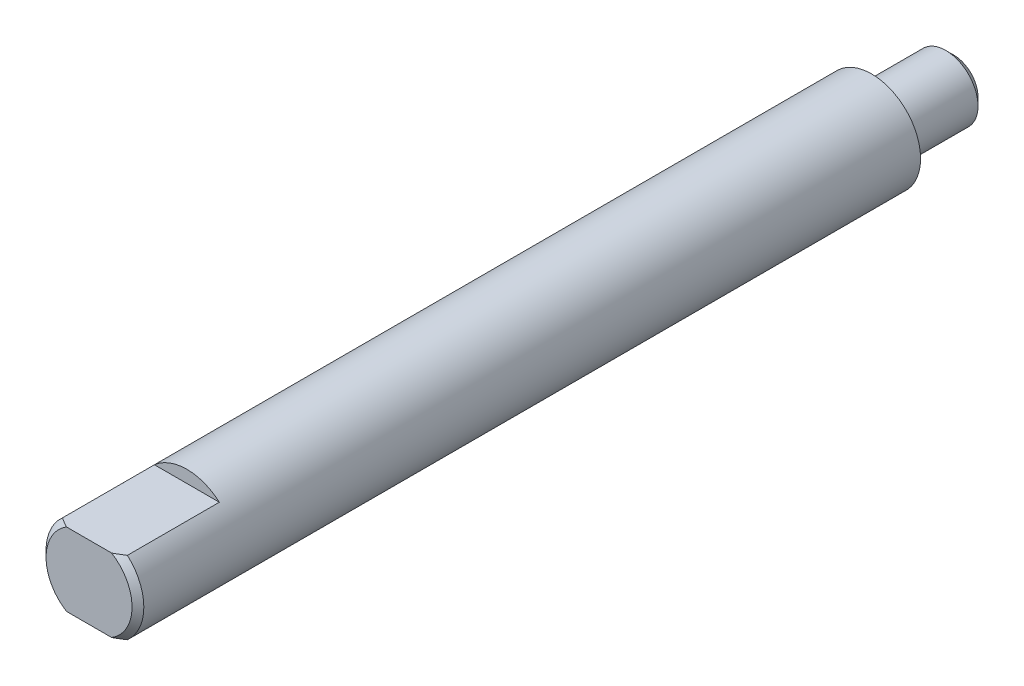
ISO-10303-21;
HEADER;
FILE_DESCRIPTION(('STEP AP214'),'2;1');
FILE_NAME('part.step','',(''),(''),'','','');
FILE_SCHEMA(('AUTOMOTIVE_DESIGN { 1 0 10303 214 1 1 1 1 }'));
ENDSEC;
DATA;
#1=APPLICATION_CONTEXT('core data for automotive mechanical design processes');
#2=APPLICATION_PROTOCOL_DEFINITION('international standard','automotive_design',2000,#1);
#3=PRODUCT_CONTEXT('',#1,'mechanical');
#4=PRODUCT('Part','Part','',(#3));
#5=PRODUCT_RELATED_PRODUCT_CATEGORY('part','',(#4));
#6=PRODUCT_DEFINITION_FORMATION('','',#4);
#7=PRODUCT_DEFINITION_CONTEXT('part definition',#1,'design');
#8=PRODUCT_DEFINITION('design','',#6,#7);
#9=PRODUCT_DEFINITION_SHAPE('','',#8);
#10=(LENGTH_UNIT() NAMED_UNIT(*) SI_UNIT(.MILLI.,.METRE.));
#11=(NAMED_UNIT(*) PLANE_ANGLE_UNIT() SI_UNIT($,.RADIAN.));
#12=(NAMED_UNIT(*) SI_UNIT($,.STERADIAN.) SOLID_ANGLE_UNIT());
#13=UNCERTAINTY_MEASURE_WITH_UNIT(LENGTH_MEASURE(1.E-05),#10,'distance_accuracy_value','');
#14=(GEOMETRIC_REPRESENTATION_CONTEXT(3) GLOBAL_UNCERTAINTY_ASSIGNED_CONTEXT((#13)) GLOBAL_UNIT_ASSIGNED_CONTEXT((#10,
#11,#12)) REPRESENTATION_CONTEXT('',''));
#15=CARTESIAN_POINT('',(0.,0.,0.));
#16=DIRECTION('',(0.,0.,1.));
#17=DIRECTION('',(1.,0.,0.));
#18=AXIS2_PLACEMENT_3D('',#15,#16,#17);
#19=CARTESIAN_POINT('',(0.,0.,3.684));
#20=DIRECTION('',(0.,0.,-1.));
#21=DIRECTION('',(-1.,0.,0.));
#22=AXIS2_PLACEMENT_3D('',#19,#20,#21);
#23=CONICAL_SURFACE('',#22,3.175,0.791934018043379);
#24=CARTESIAN_POINT('',(0.,0.,3.684));
#25=DIRECTION('',(0.,0.,1.));
#26=DIRECTION('',(1.,0.,0.));
#27=AXIS2_PLACEMENT_3D('',#24,#25,#26);
#28=CIRCLE('',#27,3.175);
#29=CARTESIAN_POINT('',(-2.10713075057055,2.375,3.684));
#30=VERTEX_POINT('',#29);
#31=CARTESIAN_POINT('',(-2.10713075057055,-2.375,3.684));
#32=VERTEX_POINT('',#31);
#33=EDGE_CURVE('E105',#30,#32,#28,.T.);
#34=ORIENTED_EDGE('',*,*,#33,.T.);
#35=CARTESIAN_POINT('',(-6.62966945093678,-2.375,-0.13301595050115));
#36=CARTESIAN_POINT('',(-6.41872085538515,-2.375,0.0629362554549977));
#37=CARTESIAN_POINT('',(-6.20729327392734,-2.375,0.258380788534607));
#38=CARTESIAN_POINT('',(-5.78286017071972,-2.375,0.64788739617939));
#39=CARTESIAN_POINT('',(-5.56985352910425,-2.375,0.841948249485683));
#40=CARTESIAN_POINT('',(-5.13574053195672,-2.375,1.23363349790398));
#41=CARTESIAN_POINT('',(-4.9145790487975,-2.375,1.43119690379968));
#42=CARTESIAN_POINT('',(-4.46963283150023,-2.375,1.82304516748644));
#43=CARTESIAN_POINT('',(-4.24585006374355,-2.375,2.01733224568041));
#44=CARTESIAN_POINT('',(-3.90719638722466,-2.375,2.30510248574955));
#45=CARTESIAN_POINT('',(-3.79385459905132,-2.375,2.40038380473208));
#46=CARTESIAN_POINT('',(-3.56590809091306,-2.375,2.5894215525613));
#47=CARTESIAN_POINT('',(-3.4513034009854,-2.375,2.68317801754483));
#48=CARTESIAN_POINT('',(-3.22025369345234,-2.375,2.86895465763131));
#49=CARTESIAN_POINT('',(-3.10380502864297,-2.375,2.96097030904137));
#50=CARTESIAN_POINT('',(-2.8689222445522,-2.375,3.14241965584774));
#51=CARTESIAN_POINT('',(-2.75048831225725,-2.375,3.23185359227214));
#52=CARTESIAN_POINT('',(-2.51255729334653,-2.375,3.40617108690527));
#53=CARTESIAN_POINT('',(-2.3930916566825,-2.375,3.49109735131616));
#54=CARTESIAN_POINT('',(-2.1509050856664,-2.375,3.65634247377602));
#55=CARTESIAN_POINT('',(-2.02818269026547,-2.375,3.73665921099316));
#56=CARTESIAN_POINT('',(-1.77912466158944,-2.375,3.89039659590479));
#57=CARTESIAN_POINT('',(-1.65280524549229,-2.375,3.96384327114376));
#58=CARTESIAN_POINT('',(-1.39512518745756,-2.375,4.10119391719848));
#59=CARTESIAN_POINT('',(-1.26377071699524,-2.375,4.16510912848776));
#60=CARTESIAN_POINT('',(-1.05701971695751,-2.375,4.25273595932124));
#61=CARTESIAN_POINT('',(-0.983728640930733,-2.375,4.28140199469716));
#62=CARTESIAN_POINT('',(-0.83535687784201,-2.375,4.3337772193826));
#63=CARTESIAN_POINT('',(-0.760275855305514,-2.375,4.35748547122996));
#64=CARTESIAN_POINT('',(-0.608898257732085,-2.375,4.39885359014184));
#65=CARTESIAN_POINT('',(-0.532610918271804,-2.375,4.41654679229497));
#66=CARTESIAN_POINT('',(-0.378780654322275,-2.375,4.445154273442));
#67=CARTESIAN_POINT('',(-0.301238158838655,-2.375,4.45607082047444));
#68=CARTESIAN_POINT('',(-0.144559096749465,-2.375,4.47054748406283));
#69=CARTESIAN_POINT('',(-0.0654144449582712,-2.375,4.47402190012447));
#70=CARTESIAN_POINT('',(0.0928249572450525,-2.375,4.47312081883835));
#71=CARTESIAN_POINT('',(0.171919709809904,-2.375,4.4687456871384));
#72=CARTESIAN_POINT('',(0.329626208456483,-2.375,4.45241265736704));
#73=CARTESIAN_POINT('',(0.408234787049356,-2.375,4.44042470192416));
#74=CARTESIAN_POINT('',(0.56408615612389,-2.375,4.40957980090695));
#75=CARTESIAN_POINT('',(0.641328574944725,-2.375,4.39072101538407));
#76=CARTESIAN_POINT('',(0.827865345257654,-2.375,4.33746225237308));
#77=CARTESIAN_POINT('',(0.936246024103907,-2.375,4.29987709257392));
#78=CARTESIAN_POINT('',(1.14927492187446,-2.375,4.21535984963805));
#79=CARTESIAN_POINT('',(1.25392057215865,-2.375,4.16842147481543));
#80=CARTESIAN_POINT('',(1.46087103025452,-2.375,4.06709514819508));
#81=CARTESIAN_POINT('',(1.56313950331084,-2.375,4.01263383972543));
#82=CARTESIAN_POINT('',(1.71427099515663,-2.375,3.92703840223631));
#83=CARTESIAN_POINT('',(1.76426245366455,-2.375,3.89786057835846));
#84=CARTESIAN_POINT('',(1.86356372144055,-2.375,3.83837009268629));
#85=CARTESIAN_POINT('',(1.91287355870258,-2.375,3.80805747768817));
#86=CARTESIAN_POINT('',(2.07522042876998,-2.375,3.70601224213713));
#87=CARTESIAN_POINT('',(2.18692206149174,-2.375,3.63215349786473));
#88=CARTESIAN_POINT('',(2.40772318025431,-2.375,3.48062951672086));
#89=CARTESIAN_POINT('',(2.5168220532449,-2.375,3.40296339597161));
#90=CARTESIAN_POINT('',(2.73301390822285,-2.375,3.24473477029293));
#91=CARTESIAN_POINT('',(2.84010537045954,-2.375,3.16417019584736));
#92=CARTESIAN_POINT('',(3.05261723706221,-2.375,3.00086187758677));
#93=CARTESIAN_POINT('',(3.15803753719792,-2.375,2.9181179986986));
#94=CARTESIAN_POINT('',(3.47300086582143,-2.375,2.6667998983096));
#95=CARTESIAN_POINT('',(3.68051445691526,-2.375,2.49568568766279));
#96=CARTESIAN_POINT('',(4.09182405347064,-2.375,2.14926116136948));
#97=CARTESIAN_POINT('',(4.29562161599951,-2.375,1.97395267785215));
#98=CARTESIAN_POINT('',(4.67931232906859,-2.375,1.63905531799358));
#99=CARTESIAN_POINT('',(4.85946034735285,-2.375,1.47975783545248));
#100=CARTESIAN_POINT('',(5.21824582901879,-2.375,1.15942835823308));
#101=CARTESIAN_POINT('',(5.39688309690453,-2.375,0.998396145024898));
#102=CARTESIAN_POINT('',(5.75173692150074,-2.375,0.676174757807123));
#103=CARTESIAN_POINT('',(5.92796166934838,-2.375,0.514994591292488));
#104=CARTESIAN_POINT('',(6.27946145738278,-2.375,0.191659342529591));
#105=CARTESIAN_POINT('',(6.45473664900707,-2.375,0.0295044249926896));
#106=CARTESIAN_POINT('',(6.62966945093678,-2.375,-0.13301595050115));
#107=B_SPLINE_CURVE_WITH_KNOTS('',3,(#35,#36,#37,#38,#39,#40,#41,#42,#43,#44,#45,#46,#47,#48,
#49,#50,#51,#52,#53,#54,#55,#56,#57,#58,#59,#60,#61,#62,#63,#64,#65,#66,#67,#68,#69,#70,#71,#72,
#73,#74,#75,#76,#77,#78,#79,#80,#81,#82,#83,#84,#85,#86,#87,#88,#89,#90,#91,#92,#93,#94,#95,#96,
#97,#98,#99,#100,#101,#102,#103,#104,#105,#106),.UNSPECIFIED.,.F.,.F.,(4,2,2,2,2,2,2,2,2,2,2,2,
2,2,2,2,2,2,2,2,2,2,2,2,2,2,2,2,2,2,2,2,2,2,2,4),(0.,0.863760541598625,1.72820709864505,
2.61784876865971,3.50686109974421,3.95106286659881,4.39525409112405,4.84047397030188,
5.28565214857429,5.72530383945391,6.16515621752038,6.60326828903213,7.04085953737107,
7.2768120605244,7.51280915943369,7.74747620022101,7.98206465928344,8.21934033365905,
8.45660495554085,8.69481223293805,8.93308334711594,9.27660606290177,9.62036064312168,
9.96774119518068,10.1413805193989,10.3150126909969,10.7166254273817,11.1183318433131,
11.5203310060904,11.9223551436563,12.7291420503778,13.5355827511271,14.2569976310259,
14.9785044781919,15.6949553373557,16.4112883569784),.UNSPECIFIED.);
#108=CARTESIAN_POINT('',(-1.46406113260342,-2.375,4.064));
#109=VERTEX_POINT('',#108);
#110=EDGE_CURVE('E128',#32,#109,#107,.T.);
#111=ORIENTED_EDGE('',*,*,#110,.T.);
#112=CARTESIAN_POINT('',(0.,0.,4.064));
#113=DIRECTION('',(0.,0.,1.));
#114=DIRECTION('',(1.,0.,0.));
#115=AXIS2_PLACEMENT_3D('',#112,#113,#114);
#116=CIRCLE('',#115,2.79);
#117=CARTESIAN_POINT('',(-1.46406113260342,2.375,4.064));
#118=VERTEX_POINT('',#117);
#119=EDGE_CURVE('E115',#118,#109,#116,.T.);
#120=ORIENTED_EDGE('',*,*,#119,.F.);
#121=CARTESIAN_POINT('',(6.62966945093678,2.375,-0.13301595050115));
#122=CARTESIAN_POINT('',(6.41872085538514,2.375,0.0629362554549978));
#123=CARTESIAN_POINT('',(6.20729327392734,2.375,0.258380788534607));
#124=CARTESIAN_POINT('',(5.78286017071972,2.375,0.64788739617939));
#125=CARTESIAN_POINT('',(5.56985352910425,2.375,0.841948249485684));
#126=CARTESIAN_POINT('',(5.13574053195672,2.375,1.23363349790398));
#127=CARTESIAN_POINT('',(4.9145790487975,2.375,1.43119690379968));
#128=CARTESIAN_POINT('',(4.46963283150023,2.375,1.82304516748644));
#129=CARTESIAN_POINT('',(4.24585006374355,2.375,2.01733224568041));
#130=CARTESIAN_POINT('',(3.90719638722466,2.375,2.30510248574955));
#131=CARTESIAN_POINT('',(3.79385459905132,2.375,2.40038380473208));
#132=CARTESIAN_POINT('',(3.56590809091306,2.375,2.5894215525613));
#133=CARTESIAN_POINT('',(3.4513034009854,2.375,2.68317801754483));
#134=CARTESIAN_POINT('',(3.22025369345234,2.375,2.86895465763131));
#135=CARTESIAN_POINT('',(3.10380502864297,2.375,2.96097030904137));
#136=CARTESIAN_POINT('',(2.8689222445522,2.375,3.14241965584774));
#137=CARTESIAN_POINT('',(2.75048831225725,2.375,3.23185359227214));
#138=CARTESIAN_POINT('',(2.51255729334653,2.375,3.40617108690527));
#139=CARTESIAN_POINT('',(2.3930916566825,2.375,3.49109735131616));
#140=CARTESIAN_POINT('',(2.1509050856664,2.375,3.65634247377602));
#141=CARTESIAN_POINT('',(2.02818269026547,2.375,3.73665921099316));
#142=CARTESIAN_POINT('',(1.77912466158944,2.375,3.89039659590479));
#143=CARTESIAN_POINT('',(1.65280524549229,2.375,3.96384327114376));
#144=CARTESIAN_POINT('',(1.39512518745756,2.375,4.10119391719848));
#145=CARTESIAN_POINT('',(1.26377071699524,2.375,4.16510912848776));
#146=CARTESIAN_POINT('',(1.05701971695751,2.375,4.25273595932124));
#147=CARTESIAN_POINT('',(0.983728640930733,2.375,4.28140199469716));
#148=CARTESIAN_POINT('',(0.83535687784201,2.375,4.3337772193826));
#149=CARTESIAN_POINT('',(0.760275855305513,2.375,4.35748547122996));
#150=CARTESIAN_POINT('',(0.608898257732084,2.375,4.39885359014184));
#151=CARTESIAN_POINT('',(0.532610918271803,2.375,4.41654679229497));
#152=CARTESIAN_POINT('',(0.378780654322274,2.375,4.445154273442));
#153=CARTESIAN_POINT('',(0.301238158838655,2.375,4.45607082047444));
#154=CARTESIAN_POINT('',(0.144559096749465,2.375,4.47054748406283));
#155=CARTESIAN_POINT('',(0.0654144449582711,2.375,4.47402190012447));
#156=CARTESIAN_POINT('',(-0.0928249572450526,2.375,4.47312081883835));
#157=CARTESIAN_POINT('',(-0.171919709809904,2.375,4.4687456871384));
#158=CARTESIAN_POINT('',(-0.329626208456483,2.375,4.45241265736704));
#159=CARTESIAN_POINT('',(-0.408234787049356,2.375,4.44042470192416));
#160=CARTESIAN_POINT('',(-0.56408615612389,2.375,4.40957980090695));
#161=CARTESIAN_POINT('',(-0.641328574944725,2.375,4.39072101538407));
#162=CARTESIAN_POINT('',(-0.827865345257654,2.375,4.33746225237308));
#163=CARTESIAN_POINT('',(-0.936246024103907,2.375,4.29987709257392));
#164=CARTESIAN_POINT('',(-1.14927492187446,2.375,4.21535984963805));
#165=CARTESIAN_POINT('',(-1.25392057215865,2.375,4.16842147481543));
#166=CARTESIAN_POINT('',(-1.46087103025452,2.375,4.06709514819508));
#167=CARTESIAN_POINT('',(-1.56313950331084,2.375,4.01263383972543));
#168=CARTESIAN_POINT('',(-1.71427099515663,2.375,3.92703840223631));
#169=CARTESIAN_POINT('',(-1.76426245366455,2.375,3.89786057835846));
#170=CARTESIAN_POINT('',(-1.86356372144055,2.375,3.83837009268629));
#171=CARTESIAN_POINT('',(-1.91287355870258,2.375,3.80805747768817));
#172=CARTESIAN_POINT('',(-2.07522042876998,2.375,3.70601224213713));
#173=CARTESIAN_POINT('',(-2.18692206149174,2.375,3.63215349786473));
#174=CARTESIAN_POINT('',(-2.40772318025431,2.375,3.48062951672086));
#175=CARTESIAN_POINT('',(-2.51682205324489,2.375,3.40296339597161));
#176=CARTESIAN_POINT('',(-2.73301390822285,2.375,3.24473477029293));
#177=CARTESIAN_POINT('',(-2.84010537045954,2.375,3.16417019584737));
#178=CARTESIAN_POINT('',(-3.05261723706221,2.375,3.00086187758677));
#179=CARTESIAN_POINT('',(-3.15803753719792,2.375,2.91811799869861));
#180=CARTESIAN_POINT('',(-3.47300086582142,2.375,2.66679989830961));
#181=CARTESIAN_POINT('',(-3.68051445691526,2.375,2.49568568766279));
#182=CARTESIAN_POINT('',(-4.09182405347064,2.375,2.14926116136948));
#183=CARTESIAN_POINT('',(-4.29562161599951,2.375,1.97395267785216));
#184=CARTESIAN_POINT('',(-4.67931232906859,2.375,1.63905531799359));
#185=CARTESIAN_POINT('',(-4.85946034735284,2.375,1.47975783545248));
#186=CARTESIAN_POINT('',(-5.21824582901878,2.375,1.15942835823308));
#187=CARTESIAN_POINT('',(-5.39688309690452,2.375,0.998396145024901));
#188=CARTESIAN_POINT('',(-5.75173692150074,2.375,0.676174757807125));
#189=CARTESIAN_POINT('',(-5.92796166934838,2.375,0.514994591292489));
#190=CARTESIAN_POINT('',(-6.27946145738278,2.375,0.191659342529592));
#191=CARTESIAN_POINT('',(-6.45473664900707,2.375,0.0295044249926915));
#192=CARTESIAN_POINT('',(-6.62966945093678,2.375,-0.13301595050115));
#193=B_SPLINE_CURVE_WITH_KNOTS('',3,(#121,#122,#123,#124,#125,#126,#127,#128,#129,#130,#131,
#132,#133,#134,#135,#136,#137,#138,#139,#140,#141,#142,#143,#144,#145,#146,#147,#148,#149,#150,
#151,#152,#153,#154,#155,#156,#157,#158,#159,#160,#161,#162,#163,#164,#165,#166,#167,#168,#169,
#170,#171,#172,#173,#174,#175,#176,#177,#178,#179,#180,#181,#182,#183,#184,#185,#186,#187,#188,
#189,#190,#191,#192),.UNSPECIFIED.,.F.,.F.,(4,2,2,2,2,2,2,2,2,2,2,2,2,2,2,2,2,2,2,2,2,2,2,2,2,2,
2,2,2,2,2,2,2,2,2,4),(0.,0.863760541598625,1.72820709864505,2.61784876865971,3.50686109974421,
3.95106286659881,4.39525409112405,4.84047397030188,5.28565214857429,5.72530383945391,
6.16515621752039,6.60326828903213,7.04085953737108,7.2768120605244,7.51280915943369,
7.74747620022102,7.98206465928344,8.21934033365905,8.45660495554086,8.69481223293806,
8.93308334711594,9.27660606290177,9.62036064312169,9.96774119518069,10.1413805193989,
10.3150126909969,10.7166254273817,11.1183318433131,11.5203310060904,11.9223551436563,
12.7291420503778,13.5355827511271,14.2569976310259,14.9785044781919,15.6949553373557,
16.4112883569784),.UNSPECIFIED.);
#194=EDGE_CURVE('E129',#118,#30,#193,.T.);
#195=ORIENTED_EDGE('',*,*,#194,.T.);
#196=EDGE_LOOP('',(#34,#111,#120,#195));
#197=FACE_BOUND('',#196,.T.);
#198=ADVANCED_FACE('F33',(#197),#23,.T.);
#199=CARTESIAN_POINT('',(0.,0.,4.064));
#200=DIRECTION('',(0.,0.,-1.));
#201=DIRECTION('',(-1.,0.,0.));
#202=AXIS2_PLACEMENT_3D('',#199,#200,#201);
#203=PLANE('',#202);
#204=ORIENTED_EDGE('',*,*,#119,.T.);
#205=DIRECTION('',(1.,0.,0.));
#206=VECTOR('',#205,1.);
#207=CARTESIAN_POINT('',(-5.,-2.375,4.064));
#208=LINE('',#207,#206);
#209=CARTESIAN_POINT('',(1.46406113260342,-2.375,4.064));
#210=VERTEX_POINT('',#209);
#211=EDGE_CURVE('E95',#109,#210,#208,.T.);
#212=ORIENTED_EDGE('',*,*,#211,.T.);
#213=CARTESIAN_POINT('',(1.46406113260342,2.375,4.064));
#214=VERTEX_POINT('',#213);
#215=EDGE_CURVE('E109',#210,#214,#116,.T.);
#216=ORIENTED_EDGE('',*,*,#215,.T.);
#217=DIRECTION('',(1.,0.,0.));
#218=VECTOR('',#217,1.);
#219=CARTESIAN_POINT('',(-5.,2.375,4.064));
#220=LINE('',#219,#218);
#221=EDGE_CURVE('E135',#118,#214,#220,.T.);
#222=ORIENTED_EDGE('',*,*,#221,.F.);
#223=EDGE_LOOP('',(#204,#212,#216,#222));
#224=FACE_BOUND('',#223,.T.);
#225=ADVANCED_FACE('F35',(#224),#203,.F.);
#226=ORIENTED_EDGE('',*,*,#215,.F.);
#227=CARTESIAN_POINT('',(2.10713075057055,-2.375,3.684));
#228=VERTEX_POINT('',#227);
#229=EDGE_CURVE('E94',#210,#228,#107,.T.);
#230=ORIENTED_EDGE('',*,*,#229,.T.);
#231=CARTESIAN_POINT('',(2.10713075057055,2.375,3.684));
#232=VERTEX_POINT('',#231);
#233=EDGE_CURVE('E101',#228,#232,#28,.T.);
#234=ORIENTED_EDGE('',*,*,#233,.T.);
#235=EDGE_CURVE('E132',#232,#214,#193,.T.);
#236=ORIENTED_EDGE('',*,*,#235,.T.);
#237=EDGE_LOOP('',(#226,#230,#234,#236));
#238=FACE_BOUND('',#237,.T.);
#239=ADVANCED_FACE('F144',(#238),#23,.T.);
#240=CARTESIAN_POINT('',(0.,0.,4.064));
#241=DIRECTION('',(0.,0.,1.));
#242=DIRECTION('',(1.,0.,0.));
#243=AXIS2_PLACEMENT_3D('',#240,#241,#242);
#244=CYLINDRICAL_SURFACE('',#243,3.175);
#245=ORIENTED_EDGE('',*,*,#233,.F.);
#246=DIRECTION('',(0.,0.,1.));
#247=VECTOR('',#246,1.);
#248=CARTESIAN_POINT('',(2.10713075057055,-2.375,4.064));
#249=LINE('',#248,#247);
#250=CARTESIAN_POINT('',(2.10713075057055,-2.375,-2.286));
#251=VERTEX_POINT('',#250);
#252=EDGE_CURVE('E11',#228,#251,#249,.F.);
#253=ORIENTED_EDGE('',*,*,#252,.T.);
#254=CARTESIAN_POINT('',(0.,0.,-2.28600000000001));
#255=DIRECTION('',(0.,0.,-1.));
#256=DIRECTION('',(0.,1.,0.));
#257=AXIS2_PLACEMENT_3D('',#254,#255,#256);
#258=CIRCLE('',#257,3.175);
#259=CARTESIAN_POINT('',(-2.10713075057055,-2.375,-2.286));
#260=VERTEX_POINT('',#259);
#261=EDGE_CURVE('E85',#251,#260,#258,.T.);
#262=ORIENTED_EDGE('',*,*,#261,.T.);
#263=DIRECTION('',(0.,0.,1.));
#264=VECTOR('',#263,1.);
#265=CARTESIAN_POINT('',(-2.10713075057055,-2.375,4.064));
#266=LINE('',#265,#264);
#267=EDGE_CURVE('E41',#260,#32,#266,.T.);
#268=ORIENTED_EDGE('',*,*,#267,.T.);
#269=ORIENTED_EDGE('',*,*,#33,.F.);
#270=DIRECTION('',(0.,0.,1.));
#271=VECTOR('',#270,1.);
#272=CARTESIAN_POINT('',(-2.10713075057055,2.375,4.064));
#273=LINE('',#272,#271);
#274=CARTESIAN_POINT('',(-2.10713075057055,2.375,-2.286));
#275=VERTEX_POINT('',#274);
#276=EDGE_CURVE('E118',#30,#275,#273,.F.);
#277=ORIENTED_EDGE('',*,*,#276,.T.);
#278=CARTESIAN_POINT('',(0.,0.,-2.28600000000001));
#279=DIRECTION('',(0.,0.,-1.));
#280=DIRECTION('',(0.,1.,0.));
#281=AXIS2_PLACEMENT_3D('',#278,#279,#280);
#282=CIRCLE('',#281,3.175);
#283=CARTESIAN_POINT('',(2.10713075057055,2.375,-2.286));
#284=VERTEX_POINT('',#283);
#285=EDGE_CURVE('E121',#275,#284,#282,.T.);
#286=ORIENTED_EDGE('',*,*,#285,.T.);
#287=DIRECTION('',(0.,0.,1.));
#288=VECTOR('',#287,1.);
#289=CARTESIAN_POINT('',(2.10713075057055,2.375,4.064));
#290=LINE('',#289,#288);
#291=EDGE_CURVE('E89',#284,#232,#290,.T.);
#292=ORIENTED_EDGE('',*,*,#291,.T.);
#293=EDGE_LOOP('',(#245,#253,#262,#268,#269,#277,#286,#292));
#294=FACE_BOUND('',#293,.T.);
#295=CARTESIAN_POINT('',(0.,0.,-46.736));
#296=DIRECTION('',(0.,0.,1.));
#297=DIRECTION('',(1.,0.,0.));
#298=AXIS2_PLACEMENT_3D('',#295,#296,#297);
#299=CIRCLE('',#298,3.175);
#300=CARTESIAN_POINT('',(3.175,0.,-46.736));
#301=VERTEX_POINT('',#300);
#302=EDGE_CURVE('E106',#301,#301,#299,.T.);
#303=ORIENTED_EDGE('',*,*,#302,.T.);
#304=EDGE_LOOP('',(#303));
#305=FACE_BOUND('',#304,.T.);
#306=ADVANCED_FACE('F98',(#294,#305),#244,.T.);
#307=CARTESIAN_POINT('',(0.,2.0828,-46.736));
#308=DIRECTION('',(0.,0.,1.));
#309=DIRECTION('',(1.,0.,0.));
#310=AXIS2_PLACEMENT_3D('',#307,#308,#309);
#311=PLANE('',#310);
#312=ORIENTED_EDGE('',*,*,#302,.F.);
#313=EDGE_LOOP('',(#312));
#314=FACE_BOUND('',#313,.T.);
#315=CARTESIAN_POINT('',(0.,0.,-46.736));
#316=DIRECTION('',(0.,0.,1.));
#317=DIRECTION('',(1.,0.,0.));
#318=AXIS2_PLACEMENT_3D('',#315,#316,#317);
#319=CIRCLE('',#318,2.0828);
#320=CARTESIAN_POINT('',(2.0828,0.,-46.736));
#321=VERTEX_POINT('',#320);
#322=EDGE_CURVE('E111',#321,#321,#319,.T.);
#323=ORIENTED_EDGE('',*,*,#322,.T.);
#324=EDGE_LOOP('',(#323));
#325=FACE_BOUND('',#324,.T.);
#326=ADVANCED_FACE('F165',(#314,#325),#311,.F.);
#327=CARTESIAN_POINT('',(0.,0.,4.064));
#328=DIRECTION('',(0.,0.,1.));
#329=DIRECTION('',(1.,0.,0.));
#330=AXIS2_PLACEMENT_3D('',#327,#328,#329);
#331=CYLINDRICAL_SURFACE('',#330,2.0828);
#332=ORIENTED_EDGE('',*,*,#322,.F.);
#333=EDGE_LOOP('',(#332));
#334=FACE_BOUND('',#333,.T.);
#335=CARTESIAN_POINT('',(0.,0.,-51.556));
#336=DIRECTION('',(0.,0.,1.));
#337=DIRECTION('',(1.,0.,0.));
#338=AXIS2_PLACEMENT_3D('',#335,#336,#337);
#339=CIRCLE('',#338,2.0828);
#340=CARTESIAN_POINT('',(2.0828,0.,-51.556));
#341=VERTEX_POINT('',#340);
#342=EDGE_CURVE('E263',#341,#341,#339,.T.);
#343=ORIENTED_EDGE('',*,*,#342,.T.);
#344=EDGE_LOOP('',(#343));
#345=FACE_BOUND('',#344,.T.);
#346=ADVANCED_FACE('F161',(#334,#345),#331,.T.);
#347=CARTESIAN_POINT('',(0.,0.,-52.066));
#348=DIRECTION('',(0.,0.,1.));
#349=DIRECTION('',(1.,0.,0.));
#350=AXIS2_PLACEMENT_3D('',#347,#348,#349);
#351=CONICAL_SURFACE('',#350,1.57280000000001,0.785398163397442);
#352=ORIENTED_EDGE('',*,*,#342,.F.);
#353=EDGE_LOOP('',(#352));
#354=FACE_BOUND('',#353,.T.);
#355=CARTESIAN_POINT('',(0.,0.,-52.066));
#356=DIRECTION('',(0.,0.,1.));
#357=DIRECTION('',(1.,0.,0.));
#358=AXIS2_PLACEMENT_3D('',#355,#356,#357);
#359=CIRCLE('',#358,1.57280000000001);
#360=CARTESIAN_POINT('',(1.57280000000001,0.,-52.066));
#361=VERTEX_POINT('',#360);
#362=EDGE_CURVE('E134',#361,#361,#359,.T.);
#363=ORIENTED_EDGE('',*,*,#362,.T.);
#364=EDGE_LOOP('',(#363));
#365=FACE_BOUND('',#364,.T.);
#366=ADVANCED_FACE('F157',(#354,#365),#351,.T.);
#367=CARTESIAN_POINT('',(0.,0.,-52.066));
#368=DIRECTION('',(0.,0.,1.));
#369=DIRECTION('',(1.,0.,0.));
#370=AXIS2_PLACEMENT_3D('',#367,#368,#369);
#371=PLANE('',#370);
#372=ORIENTED_EDGE('',*,*,#362,.F.);
#373=EDGE_LOOP('',(#372));
#374=FACE_BOUND('',#373,.T.);
#375=ADVANCED_FACE('F154',(#374),#371,.F.);
#376=CARTESIAN_POINT('',(-5.,2.375,-2.286));
#377=DIRECTION('',(0.,0.,-1.));
#378=DIRECTION('',(0.,1.,0.));
#379=AXIS2_PLACEMENT_3D('',#376,#377,#378);
#380=PLANE('',#379);
#381=ORIENTED_EDGE('',*,*,#285,.F.);
#382=DIRECTION('',(1.,0.,0.));
#383=VECTOR('',#382,1.);
#384=CARTESIAN_POINT('',(-5.,2.375,-2.286));
#385=LINE('',#384,#383);
#386=EDGE_CURVE('E55',#275,#284,#385,.T.);
#387=ORIENTED_EDGE('',*,*,#386,.T.);
#388=EDGE_LOOP('',(#381,#387));
#389=FACE_BOUND('',#388,.T.);
#390=ADVANCED_FACE('F152',(#389),#380,.F.);
#391=CARTESIAN_POINT('',(-5.,2.375,4.064));
#392=DIRECTION('',(0.,-1.,0.));
#393=DIRECTION('',(0.,0.,-1.));
#394=AXIS2_PLACEMENT_3D('',#391,#392,#393);
#395=PLANE('',#394);
#396=ORIENTED_EDGE('',*,*,#291,.F.);
#397=ORIENTED_EDGE('',*,*,#386,.F.);
#398=ORIENTED_EDGE('',*,*,#276,.F.);
#399=ORIENTED_EDGE('',*,*,#194,.F.);
#400=ORIENTED_EDGE('',*,*,#221,.T.);
#401=ORIENTED_EDGE('',*,*,#235,.F.);
#402=EDGE_LOOP('',(#396,#397,#398,#399,#400,#401));
#403=FACE_BOUND('',#402,.T.);
#404=ADVANCED_FACE('F147',(#403),#395,.F.);
#405=CARTESIAN_POINT('',(-5.,-2.375,4.064));
#406=DIRECTION('',(0.,1.,0.));
#407=DIRECTION('',(0.,0.,1.));
#408=AXIS2_PLACEMENT_3D('',#405,#406,#407);
#409=PLANE('',#408);
#410=ORIENTED_EDGE('',*,*,#267,.F.);
#411=DIRECTION('',(1.,0.,0.));
#412=VECTOR('',#411,1.);
#413=CARTESIAN_POINT('',(-5.,-2.375,-2.286));
#414=LINE('',#413,#412);
#415=EDGE_CURVE('E47',#260,#251,#414,.T.);
#416=ORIENTED_EDGE('',*,*,#415,.T.);
#417=ORIENTED_EDGE('',*,*,#252,.F.);
#418=ORIENTED_EDGE('',*,*,#229,.F.);
#419=ORIENTED_EDGE('',*,*,#211,.F.);
#420=ORIENTED_EDGE('',*,*,#110,.F.);
#421=EDGE_LOOP('',(#410,#416,#417,#418,#419,#420));
#422=FACE_BOUND('',#421,.T.);
#423=ADVANCED_FACE('F92',(#422),#409,.F.);
#424=CARTESIAN_POINT('',(-5.,-2.375,-2.286));
#425=DIRECTION('',(0.,0.,-1.));
#426=DIRECTION('',(0.,1.,0.));
#427=AXIS2_PLACEMENT_3D('',#424,#425,#426);
#428=PLANE('',#427);
#429=ORIENTED_EDGE('',*,*,#415,.F.);
#430=ORIENTED_EDGE('',*,*,#261,.F.);
#431=EDGE_LOOP('',(#429,#430));
#432=FACE_BOUND('',#431,.T.);
#433=ADVANCED_FACE('F86',(#432),#428,.F.);
#434=CLOSED_SHELL('',(#198,#225,#239,#306,#326,#346,#366,#375,#390,#404,#423,#433));
#435=MANIFOLD_SOLID_BREP('B2',#434);
#436=ADVANCED_BREP_SHAPE_REPRESENTATION('',(#18,#435),#14);
#437=SHAPE_DEFINITION_REPRESENTATION(#9,#436);
ENDSEC;
END-ISO-10303-21;
